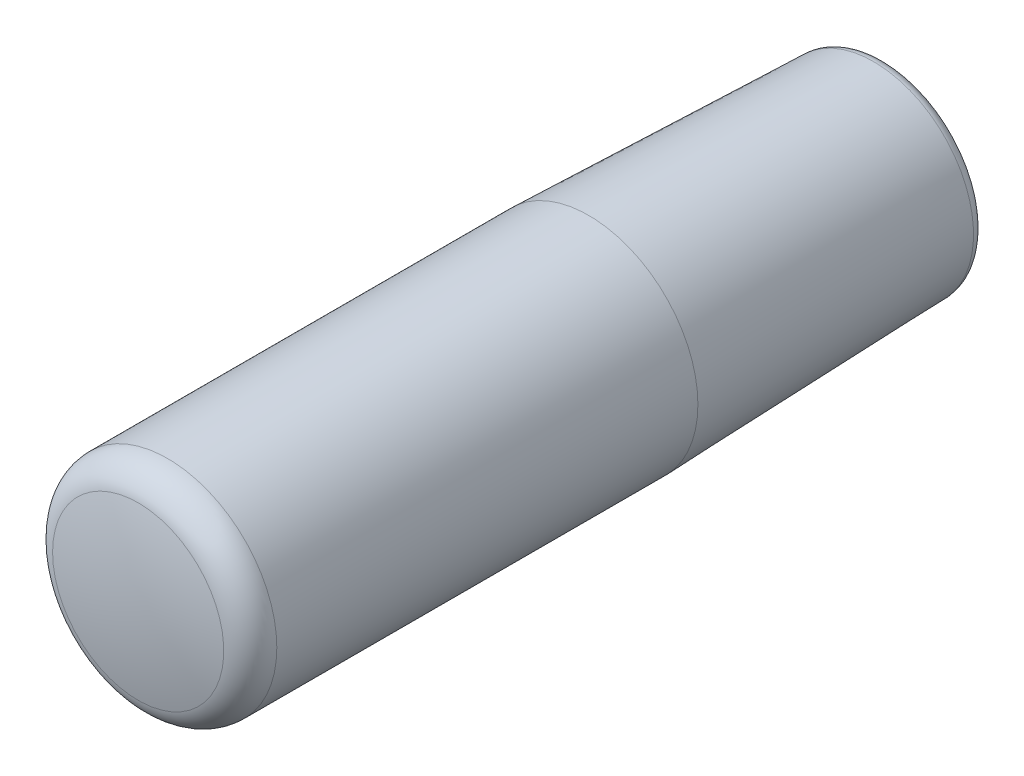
ISO-10303-21;
HEADER;
FILE_DESCRIPTION(('STEP AP214'),'2;1');
FILE_NAME('part.step','',(''),(''),'','','');
FILE_SCHEMA(('AUTOMOTIVE_DESIGN { 1 0 10303 214 1 1 1 1 }'));
ENDSEC;
DATA;
#1=APPLICATION_CONTEXT('core data for automotive mechanical design processes');
#2=APPLICATION_PROTOCOL_DEFINITION('international standard','automotive_design',2000,#1);
#3=PRODUCT_CONTEXT('',#1,'mechanical');
#4=PRODUCT('Part','Part','',(#3));
#5=PRODUCT_RELATED_PRODUCT_CATEGORY('part','',(#4));
#6=PRODUCT_DEFINITION_FORMATION('','',#4);
#7=PRODUCT_DEFINITION_CONTEXT('part definition',#1,'design');
#8=PRODUCT_DEFINITION('design','',#6,#7);
#9=PRODUCT_DEFINITION_SHAPE('','',#8);
#10=(LENGTH_UNIT() NAMED_UNIT(*) SI_UNIT(.MILLI.,.METRE.));
#11=(NAMED_UNIT(*) PLANE_ANGLE_UNIT() SI_UNIT($,.RADIAN.));
#12=(NAMED_UNIT(*) SI_UNIT($,.STERADIAN.) SOLID_ANGLE_UNIT());
#13=UNCERTAINTY_MEASURE_WITH_UNIT(LENGTH_MEASURE(1.E-05),#10,'distance_accuracy_value','');
#14=(GEOMETRIC_REPRESENTATION_CONTEXT(3) GLOBAL_UNCERTAINTY_ASSIGNED_CONTEXT((#13)) GLOBAL_UNIT_ASSIGNED_CONTEXT((#10,
#11,#12)) REPRESENTATION_CONTEXT('',''));
#15=CARTESIAN_POINT('',(0.,0.,0.));
#16=DIRECTION('',(0.,0.,1.));
#17=DIRECTION('',(1.,0.,0.));
#18=AXIS2_PLACEMENT_3D('',#15,#16,#17);
#19=CARTESIAN_POINT('',(0.,0.,46.9998721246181));
#20=DIRECTION('',(-1.,0.,0.));
#21=DIRECTION('',(0.,0.,1.));
#22=AXIS2_PLACEMENT_3D('',#19,#20,#21);
#23=SPHERICAL_SURFACE('',#22,49.9999999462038);
#24=CARTESIAN_POINT('',(0.,0.,46.9998721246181));
#25=DIRECTION('',(0.,0.,-1.));
#26=DIRECTION('',(-1.,0.,0.));
#27=AXIS2_PLACEMENT_3D('',#24,#25,#26);
#28=SPHERICAL_SURFACE('',#27,49.9999999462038);
#29=CARTESIAN_POINT('',(0.,0.,95.7803601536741));
#30=DIRECTION('',(0.,0.,-1.));
#31=DIRECTION('',(-1.,0.,0.));
#32=AXIS2_PLACEMENT_3D('',#29,#30,#31);
#33=CIRCLE('',#32,10.9756098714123);
#34=CARTESIAN_POINT('',(-10.9756098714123,0.,95.7803601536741));
#35=VERTEX_POINT('',#34);
#36=EDGE_CURVE('E8',#35,#35,#33,.T.);
#37=ORIENTED_EDGE('',*,*,#36,.F.);
#38=EDGE_LOOP('',(#37));
#39=FACE_BOUND('',#38,.T.);
#40=ADVANCED_FACE('F12',(#39),#28,.T.);
#41=CARTESIAN_POINT('',(0.,0.,91.9998727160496));
#42=DIRECTION('',(0.,0.,-1.));
#43=DIRECTION('',(-1.,0.,0.));
#44=AXIS2_PLACEMENT_3D('',#41,#42,#43);
#45=TOROIDAL_SURFACE('',#44,10.1250000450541,3.87499965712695);
#46=CARTESIAN_POINT('',(0.,0.,91.9998727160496));
#47=DIRECTION('',(0.,0.,-1.));
#48=DIRECTION('',(-1.,0.,0.));
#49=AXIS2_PLACEMENT_3D('',#46,#47,#48);
#50=CIRCLE('',#49,13.999999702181);
#51=CARTESIAN_POINT('',(-13.999999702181,0.,91.9998727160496));
#52=VERTEX_POINT('',#51);
#53=EDGE_CURVE('E18',#52,#52,#50,.T.);
#54=ORIENTED_EDGE('',*,*,#53,.F.);
#55=EDGE_LOOP('',(#54));
#56=FACE_BOUND('',#55,.T.);
#57=ORIENTED_EDGE('',*,*,#36,.T.);
#58=EDGE_LOOP('',(#57));
#59=FACE_BOUND('',#58,.T.);
#60=ADVANCED_FACE('F70',(#56,#59),#45,.T.);
#61=CARTESIAN_POINT('',(0.,0.,-4.99953637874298));
#62=DIRECTION('',(0.,0.,-1.));
#63=DIRECTION('',(-1.,0.,0.));
#64=AXIS2_PLACEMENT_3D('',#61,#62,#63);
#65=CYLINDRICAL_SURFACE('',#64,13.9999998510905);
#66=ORIENTED_EDGE('',*,*,#53,.T.);
#67=EDGE_LOOP('',(#66));
#68=FACE_BOUND('',#67,.T.);
#69=CARTESIAN_POINT('',(0.,0.,38.0004636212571));
#70=DIRECTION('',(0.,0.,-1.));
#71=DIRECTION('',(-1.,0.,0.));
#72=AXIS2_PLACEMENT_3D('',#69,#70,#71);
#73=CIRCLE('',#72,14.);
#74=CARTESIAN_POINT('',(-14.,0.,38.0004636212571));
#75=VERTEX_POINT('',#74);
#76=EDGE_CURVE('E22',#75,#75,#73,.T.);
#77=ORIENTED_EDGE('',*,*,#76,.F.);
#78=EDGE_LOOP('',(#77));
#79=FACE_BOUND('',#78,.T.);
#80=ADVANCED_FACE('F63',(#68,#79),#65,.T.);
#81=CARTESIAN_POINT('',(0.,0.,1.45068456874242));
#82=DIRECTION('',(0.,0.,1.));
#83=DIRECTION('',(1.,0.,0.));
#84=AXIS2_PLACEMENT_3D('',#81,#82,#83);
#85=CONICAL_SURFACE('',#84,12.7977046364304,0.0328828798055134);
#86=ORIENTED_EDGE('',*,*,#76,.T.);
#87=EDGE_LOOP('',(#86));
#88=FACE_BOUND('',#87,.T.);
#89=CARTESIAN_POINT('',(0.,0.,1.45068456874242));
#90=DIRECTION('',(0.,0.,-1.));
#91=DIRECTION('',(-1.,0.,0.));
#92=AXIS2_PLACEMENT_3D('',#89,#90,#91);
#93=CIRCLE('',#92,12.7977046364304);
#94=CARTESIAN_POINT('',(-12.7977046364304,0.,1.45068456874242));
#95=VERTEX_POINT('',#94);
#96=EDGE_CURVE('E26',#95,#95,#93,.T.);
#97=ORIENTED_EDGE('',*,*,#96,.F.);
#98=EDGE_LOOP('',(#97));
#99=FACE_BOUND('',#98,.T.);
#100=ADVANCED_FACE('F58',(#88,#99),#85,.T.);
#101=CARTESIAN_POINT('',(0.,0.,1.5));
#102=DIRECTION('',(0.,0.,-1.));
#103=DIRECTION('',(-1.,0.,0.));
#104=AXIS2_PLACEMENT_3D('',#101,#102,#103);
#105=TOROIDAL_SURFACE('',#104,11.2985155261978,1.5);
#106=CARTESIAN_POINT('',(0.,0.,0.));
#107=DIRECTION('',(0.,0.,-1.));
#108=DIRECTION('',(-1.,0.,0.));
#109=AXIS2_PLACEMENT_3D('',#106,#107,#108);
#110=CIRCLE('',#109,11.2985155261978);
#111=CARTESIAN_POINT('',(-11.2985155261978,0.,0.));
#112=VERTEX_POINT('',#111);
#113=EDGE_CURVE('E31',#112,#112,#110,.T.);
#114=ORIENTED_EDGE('',*,*,#113,.F.);
#115=EDGE_LOOP('',(#114));
#116=FACE_BOUND('',#115,.T.);
#117=ORIENTED_EDGE('',*,*,#96,.T.);
#118=EDGE_LOOP('',(#117));
#119=FACE_BOUND('',#118,.T.);
#120=ADVANCED_FACE('F52',(#116,#119),#105,.T.);
#121=CARTESIAN_POINT('',(0.,11.2985155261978,0.));
#122=DIRECTION('',(0.,0.,1.));
#123=DIRECTION('',(1.,0.,0.));
#124=AXIS2_PLACEMENT_3D('',#121,#122,#123);
#125=PLANE('',#124);
#126=CARTESIAN_POINT('',(0.,0.,0.));
#127=DIRECTION('',(0.,0.,-1.));
#128=DIRECTION('',(-1.,0.,0.));
#129=AXIS2_PLACEMENT_3D('',#126,#127,#128);
#130=CIRCLE('',#129,8.);
#131=CARTESIAN_POINT('',(-8.,0.,0.));
#132=VERTEX_POINT('',#131);
#133=EDGE_CURVE('E34',#132,#132,#130,.T.);
#134=ORIENTED_EDGE('',*,*,#133,.F.);
#135=EDGE_LOOP('',(#134));
#136=FACE_BOUND('',#135,.T.);
#137=ORIENTED_EDGE('',*,*,#113,.T.);
#138=EDGE_LOOP('',(#137));
#139=FACE_BOUND('',#138,.T.);
#140=ADVANCED_FACE('F46',(#136,#139),#125,.F.);
#141=CARTESIAN_POINT('',(0.,0.,-4.99953637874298));
#142=DIRECTION('',(0.,0.,-1.));
#143=DIRECTION('',(-1.,0.,0.));
#144=AXIS2_PLACEMENT_3D('',#141,#142,#143);
#145=CYLINDRICAL_SURFACE('',#144,8.);
#146=CARTESIAN_POINT('',(0.,0.,25.));
#147=DIRECTION('',(0.,0.,-1.));
#148=DIRECTION('',(-1.,0.,0.));
#149=AXIS2_PLACEMENT_3D('',#146,#147,#148);
#150=CIRCLE('',#149,8.);
#151=CARTESIAN_POINT('',(-8.,0.,25.));
#152=VERTEX_POINT('',#151);
#153=EDGE_CURVE('E37',#152,#152,#150,.T.);
#154=ORIENTED_EDGE('',*,*,#153,.F.);
#155=EDGE_LOOP('',(#154));
#156=FACE_BOUND('',#155,.T.);
#157=ORIENTED_EDGE('',*,*,#133,.T.);
#158=EDGE_LOOP('',(#157));
#159=FACE_BOUND('',#158,.T.);
#160=ADVANCED_FACE('F43',(#156,#159),#145,.F.);
#161=CARTESIAN_POINT('',(0.,0.,25.));
#162=DIRECTION('',(0.,0.,-1.));
#163=DIRECTION('',(-1.,0.,0.));
#164=AXIS2_PLACEMENT_3D('',#161,#162,#163);
#165=PLANE('',#164);
#166=ORIENTED_EDGE('',*,*,#153,.T.);
#167=EDGE_LOOP('',(#166));
#168=FACE_BOUND('',#167,.T.);
#169=ADVANCED_FACE('F41',(#168),#165,.T.);
#170=CLOSED_SHELL('',(#40,#60,#80,#100,#120,#140,#160,#169));
#171=MANIFOLD_SOLID_BREP('B1',#170);
#172=ADVANCED_BREP_SHAPE_REPRESENTATION('',(#18,#171),#14);
#173=SHAPE_DEFINITION_REPRESENTATION(#9,#172);
ENDSEC;
END-ISO-10303-21;
